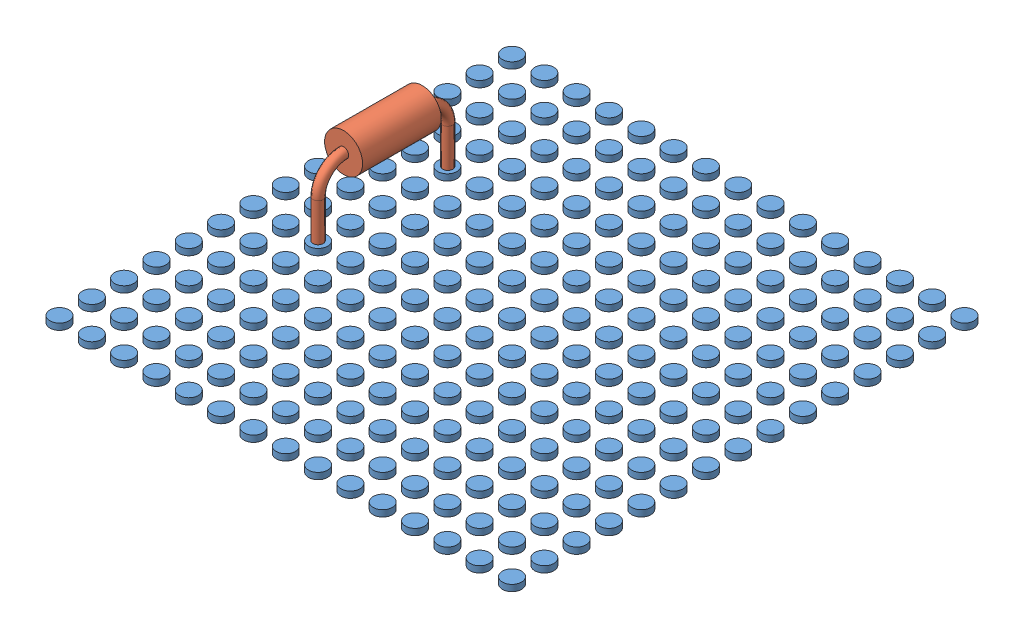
SolidWorks assembly goofy-BG.SLDASM, configuration Standard (file format 3400). Lengths in mm.
Overall size (37.06 7 37.06).
226 component instances, 2 part files, 2 mates.
Components (placement in the parent):
- Goofy-Aufnahme-1: Goofy-Aufnahme.SLDPRT [Standard] at origin size (1.5 0.5 1.5)
- Goofy-Aufnahme-2: Goofy-Aufnahme.SLDPRT [Standard] at (2.54 0 0) size (1.5 0.5 1.5)
- Goofy-Aufnahme-3: Goofy-Aufnahme.SLDPRT [Standard] at (5.08 0 0) size (1.5 0.5 1.5)
- Goofy-Aufnahme-4: Goofy-Aufnahme.SLDPRT [Standard] at (7.62 0 0) size (1.5 0.5 1.5)
- Goofy-Aufnahme-5: Goofy-Aufnahme.SLDPRT [Standard] at (10.16 0 0) size (1.5 0.5 1.5)
- Goofy-Aufnahme-6: Goofy-Aufnahme.SLDPRT [Standard] at (12.7 0 0) size (1.5 0.5 1.5)
- Goofy-Aufnahme-7: Goofy-Aufnahme.SLDPRT [Standard] at (15.24 0 0) size (1.5 0.5 1.5)
- Goofy-Aufnahme-8: Goofy-Aufnahme.SLDPRT [Standard] at (17.78 0 0) size (1.5 0.5 1.5)
- Goofy-Aufnahme-9: Goofy-Aufnahme.SLDPRT [Standard] at (20.32 0 0) size (1.5 0.5 1.5)
- Goofy-Aufnahme-10: Goofy-Aufnahme.SLDPRT [Standard] at (22.86 0 0) size (1.5 0.5 1.5)
- Goofy-Aufnahme-11: Goofy-Aufnahme.SLDPRT [Standard] at (25.4 0 0) size (1.5 0.5 1.5)
- Goofy-Aufnahme-12: Goofy-Aufnahme.SLDPRT [Standard] at (27.94 0 0) size (1.5 0.5 1.5)
- Goofy-Aufnahme-13: Goofy-Aufnahme.SLDPRT [Standard] at (30.48 0 0) size (1.5 0.5 1.5)
- Goofy-Aufnahme-14: Goofy-Aufnahme.SLDPRT [Standard] at (33.02 0 0) size (1.5 0.5 1.5)
- Goofy-Aufnahme-15: Goofy-Aufnahme.SLDPRT [Standard] at (35.56 0 0) size (1.5 0.5 1.5)
- Goofy-Aufnahme-16: Goofy-Aufnahme.SLDPRT [Standard] at (0 0 -2.54) size (1.5 0.5 1.5)
- Goofy-Aufnahme-17: Goofy-Aufnahme.SLDPRT [Standard] at (2.54 0 -2.54) size (1.5 0.5 1.5)
- Goofy-Aufnahme-18: Goofy-Aufnahme.SLDPRT [Standard] at (5.08 0 -2.54) size (1.5 0.5 1.5)
- Goofy-Aufnahme-19: Goofy-Aufnahme.SLDPRT [Standard] at (7.62 0 -2.54) size (1.5 0.5 1.5)
- Goofy-Aufnahme-20: Goofy-Aufnahme.SLDPRT [Standard] at (10.16 0 -2.54) size (1.5 0.5 1.5)
- Goofy-Aufnahme-21: Goofy-Aufnahme.SLDPRT [Standard] at (12.7 0 -2.54) size (1.5 0.5 1.5)
- Goofy-Aufnahme-22: Goofy-Aufnahme.SLDPRT [Standard] at (15.24 0 -2.54) size (1.5 0.5 1.5)
- Goofy-Aufnahme-23: Goofy-Aufnahme.SLDPRT [Standard] at (17.78 0 -2.54) size (1.5 0.5 1.5)
- Goofy-Aufnahme-24: Goofy-Aufnahme.SLDPRT [Standard] at (20.32 0 -2.54) size (1.5 0.5 1.5)
- Goofy-Aufnahme-25: Goofy-Aufnahme.SLDPRT [Standard] at (22.86 0 -2.54) size (1.5 0.5 1.5)
- Goofy-Aufnahme-26: Goofy-Aufnahme.SLDPRT [Standard] at (25.4 0 -2.54) size (1.5 0.5 1.5)
- Goofy-Aufnahme-27: Goofy-Aufnahme.SLDPRT [Standard] at (27.94 0 -2.54) size (1.5 0.5 1.5)
- Goofy-Aufnahme-28: Goofy-Aufnahme.SLDPRT [Standard] at (30.48 0 -2.54) size (1.5 0.5 1.5)
- Goofy-Aufnahme-29: Goofy-Aufnahme.SLDPRT [Standard] at (33.02 0 -2.54) size (1.5 0.5 1.5)
- Goofy-Aufnahme-30: Goofy-Aufnahme.SLDPRT [Standard] at (35.56 0 -2.54) size (1.5 0.5 1.5)
- Goofy-Aufnahme-31: Goofy-Aufnahme.SLDPRT [Standard] at (0 0 -5.08) size (1.5 0.5 1.5)
- Goofy-Aufnahme-32: Goofy-Aufnahme.SLDPRT [Standard] at (2.54 0 -5.08) size (1.5 0.5 1.5)
- Goofy-Aufnahme-33: Goofy-Aufnahme.SLDPRT [Standard] at (5.08 0 -5.08) size (1.5 0.5 1.5)
- Goofy-Aufnahme-34: Goofy-Aufnahme.SLDPRT [Standard] at (7.62 0 -5.08) size (1.5 0.5 1.5)
- Goofy-Aufnahme-35: Goofy-Aufnahme.SLDPRT [Standard] at (10.16 0 -5.08) size (1.5 0.5 1.5)
- Goofy-Aufnahme-36: Goofy-Aufnahme.SLDPRT [Standard] at (12.7 0 -5.08) size (1.5 0.5 1.5)
- Goofy-Aufnahme-37: Goofy-Aufnahme.SLDPRT [Standard] at (15.24 0 -5.08) size (1.5 0.5 1.5)
- Goofy-Aufnahme-38: Goofy-Aufnahme.SLDPRT [Standard] at (17.78 0 -5.08) size (1.5 0.5 1.5)
- Goofy-Aufnahme-39: Goofy-Aufnahme.SLDPRT [Standard] at (20.32 0 -5.08) size (1.5 0.5 1.5)
- Goofy-Aufnahme-40: Goofy-Aufnahme.SLDPRT [Standard] at (22.86 0 -5.08) size (1.5 0.5 1.5)
- Goofy-Aufnahme-41: Goofy-Aufnahme.SLDPRT [Standard] at (25.4 0 -5.08) size (1.5 0.5 1.5)
- Goofy-Aufnahme-42: Goofy-Aufnahme.SLDPRT [Standard] at (27.94 0 -5.08) size (1.5 0.5 1.5)
- Goofy-Aufnahme-43: Goofy-Aufnahme.SLDPRT [Standard] at (30.48 0 -5.08) size (1.5 0.5 1.5)
- Goofy-Aufnahme-44: Goofy-Aufnahme.SLDPRT [Standard] at (33.02 0 -5.08) size (1.5 0.5 1.5)
- Goofy-Aufnahme-45: Goofy-Aufnahme.SLDPRT [Standard] at (35.56 0 -5.08) size (1.5 0.5 1.5)
- Goofy-Aufnahme-46: Goofy-Aufnahme.SLDPRT [Standard] at (0 0 -7.62) size (1.5 0.5 1.5)
- Goofy-Aufnahme-47: Goofy-Aufnahme.SLDPRT [Standard] at (2.54 0 -7.62) size (1.5 0.5 1.5)
- Goofy-Aufnahme-48: Goofy-Aufnahme.SLDPRT [Standard] at (5.08 0 -7.62) size (1.5 0.5 1.5)
- Goofy-Aufnahme-49: Goofy-Aufnahme.SLDPRT [Standard] at (7.62 0 -7.62) size (1.5 0.5 1.5)
- Goofy-Aufnahme-50: Goofy-Aufnahme.SLDPRT [Standard] at (10.16 0 -7.62) size (1.5 0.5 1.5)
- Goofy-Aufnahme-51: Goofy-Aufnahme.SLDPRT [Standard] at (12.7 0 -7.62) size (1.5 0.5 1.5)
- Goofy-Aufnahme-52: Goofy-Aufnahme.SLDPRT [Standard] at (15.24 0 -7.62) size (1.5 0.5 1.5)
- Goofy-Aufnahme-53: Goofy-Aufnahme.SLDPRT [Standard] at (17.78 0 -7.62) size (1.5 0.5 1.5)
- Goofy-Aufnahme-54: Goofy-Aufnahme.SLDPRT [Standard] at (20.32 0 -7.62) size (1.5 0.5 1.5)
- Goofy-Aufnahme-55: Goofy-Aufnahme.SLDPRT [Standard] at (22.86 0 -7.62) size (1.5 0.5 1.5)
- Goofy-Aufnahme-56: Goofy-Aufnahme.SLDPRT [Standard] at (25.4 0 -7.62) size (1.5 0.5 1.5)
- Goofy-Aufnahme-57: Goofy-Aufnahme.SLDPRT [Standard] at (27.94 0 -7.62) size (1.5 0.5 1.5)
- Goofy-Aufnahme-58: Goofy-Aufnahme.SLDPRT [Standard] at (30.48 0 -7.62) size (1.5 0.5 1.5)
- Goofy-Aufnahme-59: Goofy-Aufnahme.SLDPRT [Standard] at (33.02 0 -7.62) size (1.5 0.5 1.5)
- Goofy-Aufnahme-60: Goofy-Aufnahme.SLDPRT [Standard] at (35.56 0 -7.62) size (1.5 0.5 1.5)
- Goofy-Aufnahme-61: Goofy-Aufnahme.SLDPRT [Standard] at (0 0 -10.16) size (1.5 0.5 1.5)
- Goofy-Aufnahme-62: Goofy-Aufnahme.SLDPRT [Standard] at (2.54 0 -10.16) size (1.5 0.5 1.5)
- Goofy-Aufnahme-63: Goofy-Aufnahme.SLDPRT [Standard] at (5.08 0 -10.16) size (1.5 0.5 1.5)
- Goofy-Aufnahme-64: Goofy-Aufnahme.SLDPRT [Standard] at (7.62 0 -10.16) size (1.5 0.5 1.5)
- Goofy-Aufnahme-65: Goofy-Aufnahme.SLDPRT [Standard] at (10.16 0 -10.16) size (1.5 0.5 1.5)
- Goofy-Aufnahme-66: Goofy-Aufnahme.SLDPRT [Standard] at (12.7 0 -10.16) size (1.5 0.5 1.5)
- Goofy-Aufnahme-67: Goofy-Aufnahme.SLDPRT [Standard] at (15.24 0 -10.16) size (1.5 0.5 1.5)
- Goofy-Aufnahme-68: Goofy-Aufnahme.SLDPRT [Standard] at (17.78 0 -10.16) size (1.5 0.5 1.5)
- Goofy-Aufnahme-69: Goofy-Aufnahme.SLDPRT [Standard] at (20.32 0 -10.16) size (1.5 0.5 1.5)
- Goofy-Aufnahme-70: Goofy-Aufnahme.SLDPRT [Standard] at (22.86 0 -10.16) size (1.5 0.5 1.5)
- Goofy-Aufnahme-71: Goofy-Aufnahme.SLDPRT [Standard] at (25.4 0 -10.16) size (1.5 0.5 1.5)
- Goofy-Aufnahme-72: Goofy-Aufnahme.SLDPRT [Standard] at (27.94 0 -10.16) size (1.5 0.5 1.5)
- Goofy-Aufnahme-73: Goofy-Aufnahme.SLDPRT [Standard] at (30.48 0 -10.16) size (1.5 0.5 1.5)
- Goofy-Aufnahme-74: Goofy-Aufnahme.SLDPRT [Standard] at (33.02 0 -10.16) size (1.5 0.5 1.5)
- Goofy-Aufnahme-75: Goofy-Aufnahme.SLDPRT [Standard] at (35.56 0 -10.16) size (1.5 0.5 1.5)
- Goofy-Aufnahme-76: Goofy-Aufnahme.SLDPRT [Standard] at (0 0 -12.7) size (1.5 0.5 1.5)
- Goofy-Aufnahme-77: Goofy-Aufnahme.SLDPRT [Standard] at (2.54 0 -12.7) size (1.5 0.5 1.5)
- Goofy-Aufnahme-78: Goofy-Aufnahme.SLDPRT [Standard] at (5.08 0 -12.7) size (1.5 0.5 1.5)
- Goofy-Aufnahme-79: Goofy-Aufnahme.SLDPRT [Standard] at (7.62 0 -12.7) size (1.5 0.5 1.5)
- Goofy-Aufnahme-80: Goofy-Aufnahme.SLDPRT [Standard] at (10.16 0 -12.7) size (1.5 0.5 1.5)
- Goofy-Aufnahme-81: Goofy-Aufnahme.SLDPRT [Standard] at (12.7 0 -12.7) size (1.5 0.5 1.5)
- Goofy-Aufnahme-82: Goofy-Aufnahme.SLDPRT [Standard] at (15.24 0 -12.7) size (1.5 0.5 1.5)
- Goofy-Aufnahme-83: Goofy-Aufnahme.SLDPRT [Standard] at (17.78 0 -12.7) size (1.5 0.5 1.5)
- Goofy-Aufnahme-84: Goofy-Aufnahme.SLDPRT [Standard] at (20.32 0 -12.7) size (1.5 0.5 1.5)
- Goofy-Aufnahme-85: Goofy-Aufnahme.SLDPRT [Standard] at (22.86 0 -12.7) size (1.5 0.5 1.5)
- Goofy-Aufnahme-86: Goofy-Aufnahme.SLDPRT [Standard] at (25.4 0 -12.7) size (1.5 0.5 1.5)
- Goofy-Aufnahme-87: Goofy-Aufnahme.SLDPRT [Standard] at (27.94 0 -12.7) size (1.5 0.5 1.5)
- Goofy-Aufnahme-88: Goofy-Aufnahme.SLDPRT [Standard] at (30.48 0 -12.7) size (1.5 0.5 1.5)
- Goofy-Aufnahme-89: Goofy-Aufnahme.SLDPRT [Standard] at (33.02 0 -12.7) size (1.5 0.5 1.5)
- Goofy-Aufnahme-90: Goofy-Aufnahme.SLDPRT [Standard] at (35.56 0 -12.7) size (1.5 0.5 1.5)
- Goofy-Aufnahme-91: Goofy-Aufnahme.SLDPRT [Standard] at (0 0 -15.24) size (1.5 0.5 1.5)
- Goofy-Aufnahme-92: Goofy-Aufnahme.SLDPRT [Standard] at (2.54 0 -15.24) size (1.5 0.5 1.5)
- Goofy-Aufnahme-93: Goofy-Aufnahme.SLDPRT [Standard] at (5.08 0 -15.24) size (1.5 0.5 1.5)
- Goofy-Aufnahme-94: Goofy-Aufnahme.SLDPRT [Standard] at (7.62 0 -15.24) size (1.5 0.5 1.5)
- Goofy-Aufnahme-95: Goofy-Aufnahme.SLDPRT [Standard] at (10.16 0 -15.24) size (1.5 0.5 1.5)
- Goofy-Aufnahme-96: Goofy-Aufnahme.SLDPRT [Standard] at (12.7 0 -15.24) size (1.5 0.5 1.5)
- Goofy-Aufnahme-97: Goofy-Aufnahme.SLDPRT [Standard] at (15.24 0 -15.24) size (1.5 0.5 1.5)
- Goofy-Aufnahme-98: Goofy-Aufnahme.SLDPRT [Standard] at (17.78 0 -15.24) size (1.5 0.5 1.5)
- Goofy-Aufnahme-99: Goofy-Aufnahme.SLDPRT [Standard] at (20.32 0 -15.24) size (1.5 0.5 1.5)
- Goofy-Aufnahme-100: Goofy-Aufnahme.SLDPRT [Standard] at (22.86 0 -15.24) size (1.5 0.5 1.5)
- Goofy-Aufnahme-101: Goofy-Aufnahme.SLDPRT [Standard] at (25.4 0 -15.24) size (1.5 0.5 1.5)
- Goofy-Aufnahme-102: Goofy-Aufnahme.SLDPRT [Standard] at (27.94 0 -15.24) size (1.5 0.5 1.5)
- Goofy-Aufnahme-103: Goofy-Aufnahme.SLDPRT [Standard] at (30.48 0 -15.24) size (1.5 0.5 1.5)
- Goofy-Aufnahme-104: Goofy-Aufnahme.SLDPRT [Standard] at (33.02 0 -15.24) size (1.5 0.5 1.5)
- Goofy-Aufnahme-105: Goofy-Aufnahme.SLDPRT [Standard] at (35.56 0 -15.24) size (1.5 0.5 1.5)
- Goofy-Aufnahme-106: Goofy-Aufnahme.SLDPRT [Standard] at (0 0 -17.78) size (1.5 0.5 1.5)
- Goofy-Aufnahme-107: Goofy-Aufnahme.SLDPRT [Standard] at (2.54 0 -17.78) size (1.5 0.5 1.5)
- Goofy-Aufnahme-108: Goofy-Aufnahme.SLDPRT [Standard] at (5.08 0 -17.78) size (1.5 0.5 1.5)
- Goofy-Aufnahme-109: Goofy-Aufnahme.SLDPRT [Standard] at (7.62 0 -17.78) size (1.5 0.5 1.5)
- Goofy-Aufnahme-110: Goofy-Aufnahme.SLDPRT [Standard] at (10.16 0 -17.78) size (1.5 0.5 1.5)
- Goofy-Aufnahme-111: Goofy-Aufnahme.SLDPRT [Standard] at (12.7 0 -17.78) size (1.5 0.5 1.5)
- Goofy-Aufnahme-112: Goofy-Aufnahme.SLDPRT [Standard] at (15.24 0 -17.78) size (1.5 0.5 1.5)
- Goofy-Aufnahme-113: Goofy-Aufnahme.SLDPRT [Standard] at (17.78 0 -17.78) size (1.5 0.5 1.5)
- Goofy-Aufnahme-114: Goofy-Aufnahme.SLDPRT [Standard] at (20.32 0 -17.78) size (1.5 0.5 1.5)
- Goofy-Aufnahme-115: Goofy-Aufnahme.SLDPRT [Standard] at (22.86 0 -17.78) size (1.5 0.5 1.5)
- Goofy-Aufnahme-116: Goofy-Aufnahme.SLDPRT [Standard] at (25.4 0 -17.78) size (1.5 0.5 1.5)
- Goofy-Aufnahme-117: Goofy-Aufnahme.SLDPRT [Standard] at (27.94 0 -17.78) size (1.5 0.5 1.5)
- Goofy-Aufnahme-118: Goofy-Aufnahme.SLDPRT [Standard] at (30.48 0 -17.78) size (1.5 0.5 1.5)
- Goofy-Aufnahme-119: Goofy-Aufnahme.SLDPRT [Standard] at (33.02 0 -17.78) size (1.5 0.5 1.5)
- Goofy-Aufnahme-120: Goofy-Aufnahme.SLDPRT [Standard] at (35.56 0 -17.78) size (1.5 0.5 1.5)
- Goofy-Aufnahme-121: Goofy-Aufnahme.SLDPRT [Standard] at (0 0 -20.32) size (1.5 0.5 1.5)
- Goofy-Aufnahme-122: Goofy-Aufnahme.SLDPRT [Standard] at (2.54 0 -20.32) size (1.5 0.5 1.5)
- Goofy-Aufnahme-123: Goofy-Aufnahme.SLDPRT [Standard] at (5.08 0 -20.32) size (1.5 0.5 1.5)
- Goofy-Aufnahme-124: Goofy-Aufnahme.SLDPRT [Standard] at (7.62 0 -20.32) size (1.5 0.5 1.5)
- Goofy-Aufnahme-125: Goofy-Aufnahme.SLDPRT [Standard] at (10.16 0 -20.32) size (1.5 0.5 1.5)
- Goofy-Aufnahme-126: Goofy-Aufnahme.SLDPRT [Standard] at (12.7 0 -20.32) size (1.5 0.5 1.5)
- Goofy-Aufnahme-127: Goofy-Aufnahme.SLDPRT [Standard] at (15.24 0 -20.32) size (1.5 0.5 1.5)
- Goofy-Aufnahme-128: Goofy-Aufnahme.SLDPRT [Standard] at (17.78 0 -20.32) size (1.5 0.5 1.5)
- Goofy-Aufnahme-129: Goofy-Aufnahme.SLDPRT [Standard] at (20.32 0 -20.32) size (1.5 0.5 1.5)
- Goofy-Aufnahme-130: Goofy-Aufnahme.SLDPRT [Standard] at (22.86 0 -20.32) size (1.5 0.5 1.5)
- Goofy-Aufnahme-131: Goofy-Aufnahme.SLDPRT [Standard] at (25.4 0 -20.32) size (1.5 0.5 1.5)
- Goofy-Aufnahme-132: Goofy-Aufnahme.SLDPRT [Standard] at (27.94 0 -20.32) size (1.5 0.5 1.5)
- Goofy-Aufnahme-133: Goofy-Aufnahme.SLDPRT [Standard] at (30.48 0 -20.32) size (1.5 0.5 1.5)
- Goofy-Aufnahme-134: Goofy-Aufnahme.SLDPRT [Standard] at (33.02 0 -20.32) size (1.5 0.5 1.5)
- Goofy-Aufnahme-135: Goofy-Aufnahme.SLDPRT [Standard] at (35.56 0 -20.32) size (1.5 0.5 1.5)
- Goofy-Aufnahme-136: Goofy-Aufnahme.SLDPRT [Standard] at (0 0 -22.86) size (1.5 0.5 1.5)
- Goofy-Aufnahme-137: Goofy-Aufnahme.SLDPRT [Standard] at (2.54 0 -22.86) size (1.5 0.5 1.5)
- Goofy-Aufnahme-138: Goofy-Aufnahme.SLDPRT [Standard] at (5.08 0 -22.86) size (1.5 0.5 1.5)
- Goofy-Aufnahme-139: Goofy-Aufnahme.SLDPRT [Standard] at (7.62 0 -22.86) size (1.5 0.5 1.5)
- Goofy-Aufnahme-140: Goofy-Aufnahme.SLDPRT [Standard] at (10.16 0 -22.86) size (1.5 0.5 1.5)
- Goofy-Aufnahme-141: Goofy-Aufnahme.SLDPRT [Standard] at (12.7 0 -22.86) size (1.5 0.5 1.5)
- Goofy-Aufnahme-142: Goofy-Aufnahme.SLDPRT [Standard] at (15.24 0 -22.86) size (1.5 0.5 1.5)
- Goofy-Aufnahme-143: Goofy-Aufnahme.SLDPRT [Standard] at (17.78 0 -22.86) size (1.5 0.5 1.5)
- Goofy-Aufnahme-144: Goofy-Aufnahme.SLDPRT [Standard] at (20.32 0 -22.86) size (1.5 0.5 1.5)
- Goofy-Aufnahme-145: Goofy-Aufnahme.SLDPRT [Standard] at (22.86 0 -22.86) size (1.5 0.5 1.5)
- Goofy-Aufnahme-146: Goofy-Aufnahme.SLDPRT [Standard] at (25.4 0 -22.86) size (1.5 0.5 1.5)
- Goofy-Aufnahme-147: Goofy-Aufnahme.SLDPRT [Standard] at (27.94 0 -22.86) size (1.5 0.5 1.5)
- Goofy-Aufnahme-148: Goofy-Aufnahme.SLDPRT [Standard] at (30.48 0 -22.86) size (1.5 0.5 1.5)
- Goofy-Aufnahme-149: Goofy-Aufnahme.SLDPRT [Standard] at (33.02 0 -22.86) size (1.5 0.5 1.5)
- Goofy-Aufnahme-150: Goofy-Aufnahme.SLDPRT [Standard] at (35.56 0 -22.86) size (1.5 0.5 1.5)
- Goofy-Aufnahme-151: Goofy-Aufnahme.SLDPRT [Standard] at (0 0 -25.4) size (1.5 0.5 1.5)
- Goofy-Aufnahme-152: Goofy-Aufnahme.SLDPRT [Standard] at (2.54 0 -25.4) size (1.5 0.5 1.5)
- Goofy-Aufnahme-153: Goofy-Aufnahme.SLDPRT [Standard] at (5.08 0 -25.4) size (1.5 0.5 1.5)
- Goofy-Aufnahme-154: Goofy-Aufnahme.SLDPRT [Standard] at (7.62 0 -25.4) size (1.5 0.5 1.5)
- Goofy-Aufnahme-155: Goofy-Aufnahme.SLDPRT [Standard] at (10.16 0 -25.4) size (1.5 0.5 1.5)
- Goofy-Aufnahme-156: Goofy-Aufnahme.SLDPRT [Standard] at (12.7 0 -25.4) size (1.5 0.5 1.5)
- Goofy-Aufnahme-157: Goofy-Aufnahme.SLDPRT [Standard] at (15.24 0 -25.4) size (1.5 0.5 1.5)
- Goofy-Aufnahme-158: Goofy-Aufnahme.SLDPRT [Standard] at (17.78 0 -25.4) size (1.5 0.5 1.5)
- Goofy-Aufnahme-159: Goofy-Aufnahme.SLDPRT [Standard] at (20.32 0 -25.4) size (1.5 0.5 1.5)
- Goofy-Aufnahme-160: Goofy-Aufnahme.SLDPRT [Standard] at (22.86 0 -25.4) size (1.5 0.5 1.5)
- Goofy-Aufnahme-161: Goofy-Aufnahme.SLDPRT [Standard] at (25.4 0 -25.4) size (1.5 0.5 1.5)
- Goofy-Aufnahme-162: Goofy-Aufnahme.SLDPRT [Standard] at (27.94 0 -25.4) size (1.5 0.5 1.5)
- Goofy-Aufnahme-163: Goofy-Aufnahme.SLDPRT [Standard] at (30.48 0 -25.4) size (1.5 0.5 1.5)
- Goofy-Aufnahme-164: Goofy-Aufnahme.SLDPRT [Standard] at (33.02 0 -25.4) size (1.5 0.5 1.5)
- Goofy-Aufnahme-165: Goofy-Aufnahme.SLDPRT [Standard] at (35.56 0 -25.4) size (1.5 0.5 1.5)
- Goofy-Aufnahme-166: Goofy-Aufnahme.SLDPRT [Standard] at (0 0 -27.94) size (1.5 0.5 1.5)
- Goofy-Aufnahme-167: Goofy-Aufnahme.SLDPRT [Standard] at (2.54 0 -27.94) size (1.5 0.5 1.5)
- Goofy-Aufnahme-168: Goofy-Aufnahme.SLDPRT [Standard] at (5.08 0 -27.94) size (1.5 0.5 1.5)
- Goofy-Aufnahme-169: Goofy-Aufnahme.SLDPRT [Standard] at (7.62 0 -27.94) size (1.5 0.5 1.5)
- Goofy-Aufnahme-170: Goofy-Aufnahme.SLDPRT [Standard] at (10.16 0 -27.94) size (1.5 0.5 1.5)
- Goofy-Aufnahme-171: Goofy-Aufnahme.SLDPRT [Standard] at (12.7 0 -27.94) size (1.5 0.5 1.5)
- Goofy-Aufnahme-172: Goofy-Aufnahme.SLDPRT [Standard] at (15.24 0 -27.94) size (1.5 0.5 1.5)
- Goofy-Aufnahme-173: Goofy-Aufnahme.SLDPRT [Standard] at (17.78 0 -27.94) size (1.5 0.5 1.5)
- Goofy-Aufnahme-174: Goofy-Aufnahme.SLDPRT [Standard] at (20.32 0 -27.94) size (1.5 0.5 1.5)
- Goofy-Aufnahme-175: Goofy-Aufnahme.SLDPRT [Standard] at (22.86 0 -27.94) size (1.5 0.5 1.5)
- Goofy-Aufnahme-176: Goofy-Aufnahme.SLDPRT [Standard] at (25.4 0 -27.94) size (1.5 0.5 1.5)
- Goofy-Aufnahme-177: Goofy-Aufnahme.SLDPRT [Standard] at (27.94 0 -27.94) size (1.5 0.5 1.5)
- Goofy-Aufnahme-178: Goofy-Aufnahme.SLDPRT [Standard] at (30.48 0 -27.94) size (1.5 0.5 1.5)
- Goofy-Aufnahme-179: Goofy-Aufnahme.SLDPRT [Standard] at (33.02 0 -27.94) size (1.5 0.5 1.5)
- Goofy-Aufnahme-180: Goofy-Aufnahme.SLDPRT [Standard] at (35.56 0 -27.94) size (1.5 0.5 1.5)
- Goofy-Aufnahme-181: Goofy-Aufnahme.SLDPRT [Standard] at (0 0 -30.48) size (1.5 0.5 1.5)
- Goofy-Aufnahme-182: Goofy-Aufnahme.SLDPRT [Standard] at (2.54 0 -30.48) size (1.5 0.5 1.5)
- Goofy-Aufnahme-183: Goofy-Aufnahme.SLDPRT [Standard] at (5.08 0 -30.48) size (1.5 0.5 1.5)
- Goofy-Aufnahme-184: Goofy-Aufnahme.SLDPRT [Standard] at (7.62 0 -30.48) size (1.5 0.5 1.5)
- Goofy-Aufnahme-185: Goofy-Aufnahme.SLDPRT [Standard] at (10.16 0 -30.48) size (1.5 0.5 1.5)
- Goofy-Aufnahme-186: Goofy-Aufnahme.SLDPRT [Standard] at (12.7 0 -30.48) size (1.5 0.5 1.5)
- Goofy-Aufnahme-187: Goofy-Aufnahme.SLDPRT [Standard] at (15.24 0 -30.48) size (1.5 0.5 1.5)
- Goofy-Aufnahme-188: Goofy-Aufnahme.SLDPRT [Standard] at (17.78 0 -30.48) size (1.5 0.5 1.5)
- Goofy-Aufnahme-189: Goofy-Aufnahme.SLDPRT [Standard] at (20.32 0 -30.48) size (1.5 0.5 1.5)
- Goofy-Aufnahme-190: Goofy-Aufnahme.SLDPRT [Standard] at (22.86 0 -30.48) size (1.5 0.5 1.5)
- Goofy-Aufnahme-191: Goofy-Aufnahme.SLDPRT [Standard] at (25.4 0 -30.48) size (1.5 0.5 1.5)
- Goofy-Aufnahme-192: Goofy-Aufnahme.SLDPRT [Standard] at (27.94 0 -30.48) size (1.5 0.5 1.5)
- Goofy-Aufnahme-193: Goofy-Aufnahme.SLDPRT [Standard] at (30.48 0 -30.48) size (1.5 0.5 1.5)
- Goofy-Aufnahme-194: Goofy-Aufnahme.SLDPRT [Standard] at (33.02 0 -30.48) size (1.5 0.5 1.5)
- Goofy-Aufnahme-195: Goofy-Aufnahme.SLDPRT [Standard] at (35.56 0 -30.48) size (1.5 0.5 1.5)
- Goofy-Aufnahme-196: Goofy-Aufnahme.SLDPRT [Standard] at (0 0 -33.02) size (1.5 0.5 1.5)
- Goofy-Aufnahme-197: Goofy-Aufnahme.SLDPRT [Standard] at (2.54 0 -33.02) size (1.5 0.5 1.5)
- Goofy-Aufnahme-198: Goofy-Aufnahme.SLDPRT [Standard] at (5.08 0 -33.02) size (1.5 0.5 1.5)
- Goofy-Aufnahme-199: Goofy-Aufnahme.SLDPRT [Standard] at (7.62 0 -33.02) size (1.5 0.5 1.5)
- Goofy-Aufnahme-200: Goofy-Aufnahme.SLDPRT [Standard] at (10.16 0 -33.02) size (1.5 0.5 1.5)
- Goofy-Aufnahme-201: Goofy-Aufnahme.SLDPRT [Standard] at (12.7 0 -33.02) size (1.5 0.5 1.5)
- Goofy-Aufnahme-202: Goofy-Aufnahme.SLDPRT [Standard] at (15.24 0 -33.02) size (1.5 0.5 1.5)
- Goofy-Aufnahme-203: Goofy-Aufnahme.SLDPRT [Standard] at (17.78 0 -33.02) size (1.5 0.5 1.5)
- Goofy-Aufnahme-204: Goofy-Aufnahme.SLDPRT [Standard] at (20.32 0 -33.02) size (1.5 0.5 1.5)
- Goofy-Aufnahme-205: Goofy-Aufnahme.SLDPRT [Standard] at (22.86 0 -33.02) size (1.5 0.5 1.5)
- Goofy-Aufnahme-206: Goofy-Aufnahme.SLDPRT [Standard] at (25.4 0 -33.02) size (1.5 0.5 1.5)
- Goofy-Aufnahme-207: Goofy-Aufnahme.SLDPRT [Standard] at (27.94 0 -33.02) size (1.5 0.5 1.5)
- Goofy-Aufnahme-208: Goofy-Aufnahme.SLDPRT [Standard] at (30.48 0 -33.02) size (1.5 0.5 1.5)
- Goofy-Aufnahme-209: Goofy-Aufnahme.SLDPRT [Standard] at (33.02 0 -33.02) size (1.5 0.5 1.5)
- Goofy-Aufnahme-210: Goofy-Aufnahme.SLDPRT [Standard] at (35.56 0 -33.02) size (1.5 0.5 1.5)
- Goofy-Aufnahme-211: Goofy-Aufnahme.SLDPRT [Standard] at (0 0 -35.56) size (1.5 0.5 1.5)
- Goofy-Aufnahme-212: Goofy-Aufnahme.SLDPRT [Standard] at (2.54 0 -35.56) size (1.5 0.5 1.5)
- Goofy-Aufnahme-213: Goofy-Aufnahme.SLDPRT [Standard] at (5.08 0 -35.56) size (1.5 0.5 1.5)
- Goofy-Aufnahme-214: Goofy-Aufnahme.SLDPRT [Standard] at (7.62 0 -35.56) size (1.5 0.5 1.5)
- Goofy-Aufnahme-215: Goofy-Aufnahme.SLDPRT [Standard] at (10.16 0 -35.56) size (1.5 0.5 1.5)
- Goofy-Aufnahme-216: Goofy-Aufnahme.SLDPRT [Standard] at (12.7 0 -35.56) size (1.5 0.5 1.5)
- Goofy-Aufnahme-217: Goofy-Aufnahme.SLDPRT [Standard] at (15.24 0 -35.56) size (1.5 0.5 1.5)
- Goofy-Aufnahme-218: Goofy-Aufnahme.SLDPRT [Standard] at (17.78 0 -35.56) size (1.5 0.5 1.5)
- Goofy-Aufnahme-219: Goofy-Aufnahme.SLDPRT [Standard] at (20.32 0 -35.56) size (1.5 0.5 1.5)
- Goofy-Aufnahme-220: Goofy-Aufnahme.SLDPRT [Standard] at (22.86 0 -35.56) size (1.5 0.5 1.5)
- Goofy-Aufnahme-221: Goofy-Aufnahme.SLDPRT [Standard] at (25.4 0 -35.56) size (1.5 0.5 1.5)
- Goofy-Aufnahme-222: Goofy-Aufnahme.SLDPRT [Standard] at (27.94 0 -35.56) size (1.5 0.5 1.5)
- Goofy-Aufnahme-223: Goofy-Aufnahme.SLDPRT [Standard] at (30.48 0 -35.56) size (1.5 0.5 1.5)
- Goofy-Aufnahme-224: Goofy-Aufnahme.SLDPRT [Standard] at (33.02 0 -35.56) size (1.5 0.5 1.5)
- Goofy-Aufnahme-225: Goofy-Aufnahme.SLDPRT [Standard] at (35.56 0 -35.56) size (1.5 0.5 1.5)
- Goofy-Bauteil-2: Goofy-Bauteil.SLDPRT [Standard] at (5.08 0.5 -15.24) x (0.003231 0 -0.999995) z (0.999995 0 0.003231) size (10.96 6.5 3)
Mates (geometry in assembly coordinates):
- Deckungsgleich21: coincident anti-aligned: plane of Goofy-Aufnahme-93 through (5.08 0.5 -15.24) normal (0 1 0); plane of Goofy-Bauteil-2 through (5.08 0.5 -15.24) normal (0 -1 0)
- Deckungsgleich31: coincident anti-aligned: line of Goofy-Aufnahme-93; axis of Goofy-Bauteil-2
